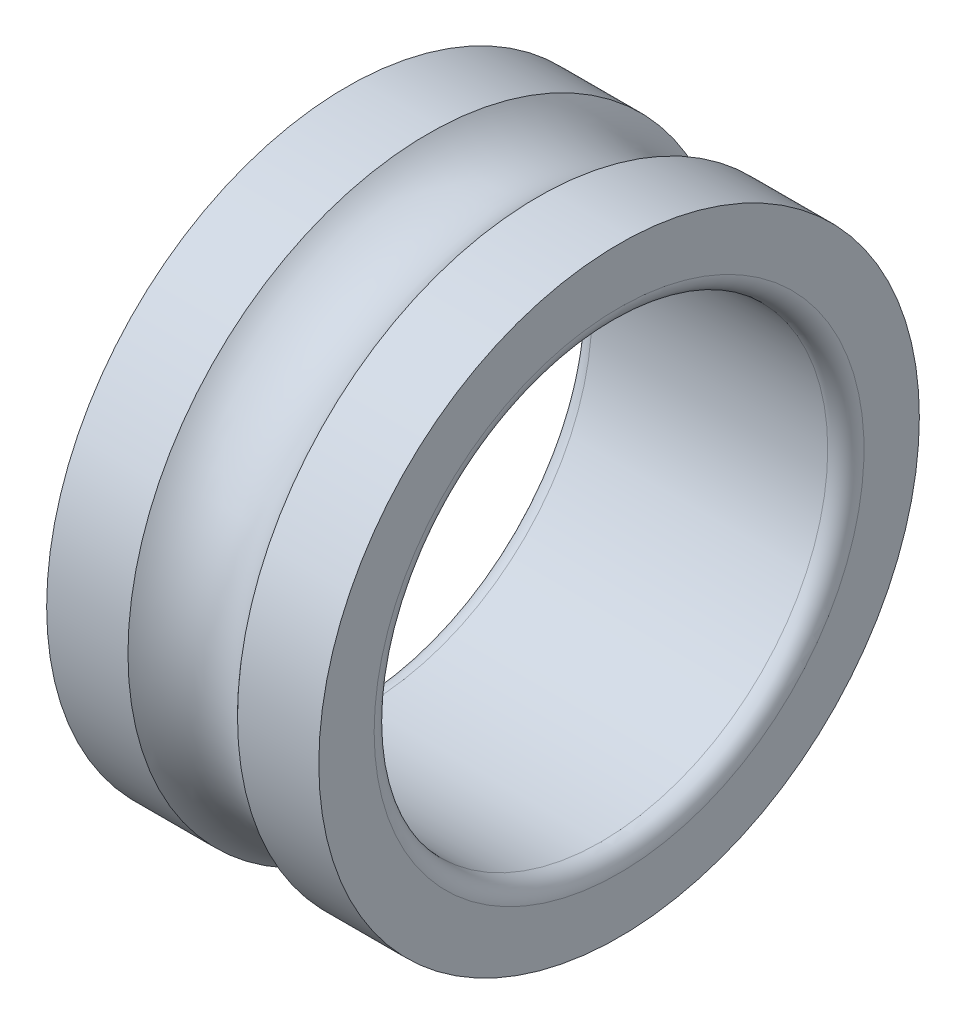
ISO-10303-21;
HEADER;
FILE_DESCRIPTION(('STEP AP214'),'2;1');
FILE_NAME('part.step','',(''),(''),'','','');
FILE_SCHEMA(('AUTOMOTIVE_DESIGN { 1 0 10303 214 1 1 1 1 }'));
ENDSEC;
DATA;
#1=APPLICATION_CONTEXT('core data for automotive mechanical design processes');
#2=APPLICATION_PROTOCOL_DEFINITION('international standard','automotive_design',2000,#1);
#3=PRODUCT_CONTEXT('',#1,'mechanical');
#4=PRODUCT('Part','Part','',(#3));
#5=PRODUCT_RELATED_PRODUCT_CATEGORY('part','',(#4));
#6=PRODUCT_DEFINITION_FORMATION('','',#4);
#7=PRODUCT_DEFINITION_CONTEXT('part definition',#1,'design');
#8=PRODUCT_DEFINITION('design','',#6,#7);
#9=PRODUCT_DEFINITION_SHAPE('','',#8);
#10=(LENGTH_UNIT() NAMED_UNIT(*) SI_UNIT(.MILLI.,.METRE.));
#11=(NAMED_UNIT(*) PLANE_ANGLE_UNIT() SI_UNIT($,.RADIAN.));
#12=(NAMED_UNIT(*) SI_UNIT($,.STERADIAN.) SOLID_ANGLE_UNIT());
#13=UNCERTAINTY_MEASURE_WITH_UNIT(LENGTH_MEASURE(1.E-05),#10,'distance_accuracy_value','');
#14=(GEOMETRIC_REPRESENTATION_CONTEXT(3) GLOBAL_UNCERTAINTY_ASSIGNED_CONTEXT((#13)) GLOBAL_UNIT_ASSIGNED_CONTEXT((#10,
#11,#12)) REPRESENTATION_CONTEXT('',''));
#15=CARTESIAN_POINT('',(0.,0.,0.));
#16=DIRECTION('',(0.,0.,1.));
#17=DIRECTION('',(1.,0.,0.));
#18=AXIS2_PLACEMENT_3D('',#15,#16,#17);
#19=CARTESIAN_POINT('',(1.,0.,0.));
#20=DIRECTION('',(-1.,0.,0.));
#21=DIRECTION('',(0.,0.,1.));
#22=AXIS2_PLACEMENT_3D('',#19,#20,#21);
#23=TOROIDAL_SURFACE('',#22,13.5,1.);
#24=CARTESIAN_POINT('',(1.,0.,0.));
#25=DIRECTION('',(-1.,0.,0.));
#26=DIRECTION('',(0.,0.,1.));
#27=AXIS2_PLACEMENT_3D('',#24,#25,#26);
#28=CIRCLE('',#27,12.5);
#29=CARTESIAN_POINT('',(1.,0.,12.5));
#30=VERTEX_POINT('',#29);
#31=EDGE_CURVE('E10',#30,#30,#28,.T.);
#32=ORIENTED_EDGE('',*,*,#31,.F.);
#33=EDGE_LOOP('',(#32));
#34=FACE_BOUND('',#33,.T.);
#35=CARTESIAN_POINT('',(0.,0.,0.));
#36=DIRECTION('',(-1.,0.,0.));
#37=DIRECTION('',(0.,0.,1.));
#38=AXIS2_PLACEMENT_3D('',#35,#36,#37);
#39=CIRCLE('',#38,13.5);
#40=CARTESIAN_POINT('',(0.,0.,13.5));
#41=VERTEX_POINT('',#40);
#42=EDGE_CURVE('E53',#41,#41,#39,.T.);
#43=ORIENTED_EDGE('',*,*,#42,.T.);
#44=EDGE_LOOP('',(#43));
#45=FACE_BOUND('',#44,.T.);
#46=ADVANCED_FACE('F25',(#34,#45),#23,.T.);
#47=CARTESIAN_POINT('',(0.,0.,0.));
#48=DIRECTION('',(-1.,0.,0.));
#49=DIRECTION('',(0.,0.,1.));
#50=AXIS2_PLACEMENT_3D('',#47,#48,#49);
#51=CYLINDRICAL_SURFACE('',#50,12.5);
#52=CARTESIAN_POINT('',(14.,0.,0.));
#53=DIRECTION('',(-1.,0.,0.));
#54=DIRECTION('',(0.,0.,1.));
#55=AXIS2_PLACEMENT_3D('',#52,#53,#54);
#56=CIRCLE('',#55,12.5);
#57=CARTESIAN_POINT('',(14.,0.,12.5));
#58=VERTEX_POINT('',#57);
#59=EDGE_CURVE('E31',#58,#58,#56,.T.);
#60=ORIENTED_EDGE('',*,*,#59,.F.);
#61=EDGE_LOOP('',(#60));
#62=FACE_BOUND('',#61,.T.);
#63=ORIENTED_EDGE('',*,*,#31,.T.);
#64=EDGE_LOOP('',(#63));
#65=FACE_BOUND('',#64,.T.);
#66=ADVANCED_FACE('F90',(#62,#65),#51,.F.);
#67=CARTESIAN_POINT('',(14.,0.,0.));
#68=DIRECTION('',(-1.,0.,0.));
#69=DIRECTION('',(0.,0.,1.));
#70=AXIS2_PLACEMENT_3D('',#67,#68,#69);
#71=TOROIDAL_SURFACE('',#70,13.5,1.);
#72=CARTESIAN_POINT('',(15.,0.,0.));
#73=DIRECTION('',(-1.,0.,0.));
#74=DIRECTION('',(0.,0.,1.));
#75=AXIS2_PLACEMENT_3D('',#72,#73,#74);
#76=CIRCLE('',#75,13.5);
#77=CARTESIAN_POINT('',(15.,0.,13.5));
#78=VERTEX_POINT('',#77);
#79=EDGE_CURVE('E35',#78,#78,#76,.T.);
#80=ORIENTED_EDGE('',*,*,#79,.F.);
#81=EDGE_LOOP('',(#80));
#82=FACE_BOUND('',#81,.T.);
#83=ORIENTED_EDGE('',*,*,#59,.T.);
#84=EDGE_LOOP('',(#83));
#85=FACE_BOUND('',#84,.T.);
#86=ADVANCED_FACE('F85',(#82,#85),#71,.T.);
#87=CARTESIAN_POINT('',(15.,0.,-16.55));
#88=DIRECTION('',(-1.,0.,0.));
#89=DIRECTION('',(0.,0.,1.));
#90=AXIS2_PLACEMENT_3D('',#87,#88,#89);
#91=PLANE('',#90);
#92=CARTESIAN_POINT('',(15.,0.,0.));
#93=DIRECTION('',(-1.,0.,0.));
#94=DIRECTION('',(0.,0.,1.));
#95=AXIS2_PLACEMENT_3D('',#92,#93,#94);
#96=CIRCLE('',#95,16.55);
#97=CARTESIAN_POINT('',(15.,0.,16.55));
#98=VERTEX_POINT('',#97);
#99=EDGE_CURVE('E39',#98,#98,#96,.T.);
#100=ORIENTED_EDGE('',*,*,#99,.F.);
#101=EDGE_LOOP('',(#100));
#102=FACE_BOUND('',#101,.T.);
#103=ORIENTED_EDGE('',*,*,#79,.T.);
#104=EDGE_LOOP('',(#103));
#105=FACE_BOUND('',#104,.T.);
#106=ADVANCED_FACE('F79',(#102,#105),#91,.F.);
#107=CARTESIAN_POINT('',(0.,0.,0.));
#108=DIRECTION('',(-1.,0.,0.));
#109=DIRECTION('',(0.,0.,1.));
#110=AXIS2_PLACEMENT_3D('',#107,#108,#109);
#111=CYLINDRICAL_SURFACE('',#110,16.55);
#112=CARTESIAN_POINT('',(10.5186917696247,0.,0.));
#113=DIRECTION('',(-1.,0.,0.));
#114=DIRECTION('',(0.,0.,1.));
#115=AXIS2_PLACEMENT_3D('',#112,#113,#114);
#116=CIRCLE('',#115,16.55);
#117=CARTESIAN_POINT('',(10.5186917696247,0.,16.55));
#118=VERTEX_POINT('',#117);
#119=EDGE_CURVE('E44',#118,#118,#116,.T.);
#120=ORIENTED_EDGE('',*,*,#119,.F.);
#121=EDGE_LOOP('',(#120));
#122=FACE_BOUND('',#121,.T.);
#123=ORIENTED_EDGE('',*,*,#99,.T.);
#124=EDGE_LOOP('',(#123));
#125=FACE_BOUND('',#124,.T.);
#126=ADVANCED_FACE('F73',(#122,#125),#111,.T.);
#127=CARTESIAN_POINT('',(7.50000000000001,0.,0.));
#128=DIRECTION('',(-1.,0.,0.));
#129=DIRECTION('',(0.,0.,1.));
#130=AXIS2_PLACEMENT_3D('',#127,#128,#129);
#131=TOROIDAL_SURFACE('',#130,19.25,4.05);
#132=CARTESIAN_POINT('',(4.48130823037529,0.,0.));
#133=DIRECTION('',(-1.,0.,0.));
#134=DIRECTION('',(0.,0.,1.));
#135=AXIS2_PLACEMENT_3D('',#132,#133,#134);
#136=CIRCLE('',#135,16.55);
#137=CARTESIAN_POINT('',(4.48130823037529,0.,16.55));
#138=VERTEX_POINT('',#137);
#139=EDGE_CURVE('E47',#138,#138,#136,.T.);
#140=ORIENTED_EDGE('',*,*,#139,.F.);
#141=EDGE_LOOP('',(#140));
#142=FACE_BOUND('',#141,.T.);
#143=ORIENTED_EDGE('',*,*,#119,.T.);
#144=EDGE_LOOP('',(#143));
#145=FACE_BOUND('',#144,.T.);
#146=ADVANCED_FACE('F67',(#142,#145),#131,.F.);
#147=CARTESIAN_POINT('',(0.,0.,0.));
#148=DIRECTION('',(-1.,0.,0.));
#149=DIRECTION('',(0.,0.,1.));
#150=AXIS2_PLACEMENT_3D('',#147,#148,#149);
#151=CYLINDRICAL_SURFACE('',#150,16.55);
#152=CARTESIAN_POINT('',(0.,0.,0.));
#153=DIRECTION('',(-1.,0.,0.));
#154=DIRECTION('',(0.,0.,1.));
#155=AXIS2_PLACEMENT_3D('',#152,#153,#154);
#156=CIRCLE('',#155,16.55);
#157=CARTESIAN_POINT('',(0.,0.,16.55));
#158=VERTEX_POINT('',#157);
#159=EDGE_CURVE('E50',#158,#158,#156,.T.);
#160=ORIENTED_EDGE('',*,*,#159,.F.);
#161=EDGE_LOOP('',(#160));
#162=FACE_BOUND('',#161,.T.);
#163=ORIENTED_EDGE('',*,*,#139,.T.);
#164=EDGE_LOOP('',(#163));
#165=FACE_BOUND('',#164,.T.);
#166=ADVANCED_FACE('F61',(#162,#165),#151,.T.);
#167=CARTESIAN_POINT('',(0.,0.,-16.55));
#168=DIRECTION('',(1.,0.,0.));
#169=DIRECTION('',(0.,0.,-1.));
#170=AXIS2_PLACEMENT_3D('',#167,#168,#169);
#171=PLANE('',#170);
#172=ORIENTED_EDGE('',*,*,#42,.F.);
#173=EDGE_LOOP('',(#172));
#174=FACE_BOUND('',#173,.T.);
#175=ORIENTED_EDGE('',*,*,#159,.T.);
#176=EDGE_LOOP('',(#175));
#177=FACE_BOUND('',#176,.T.);
#178=ADVANCED_FACE('F58',(#174,#177),#171,.F.);
#179=CLOSED_SHELL('',(#46,#66,#86,#106,#126,#146,#166,#178));
#180=MANIFOLD_SOLID_BREP('B2',#179);
#181=ADVANCED_BREP_SHAPE_REPRESENTATION('',(#18,#180),#14);
#182=SHAPE_DEFINITION_REPRESENTATION(#9,#181);
ENDSEC;
END-ISO-10303-21;
